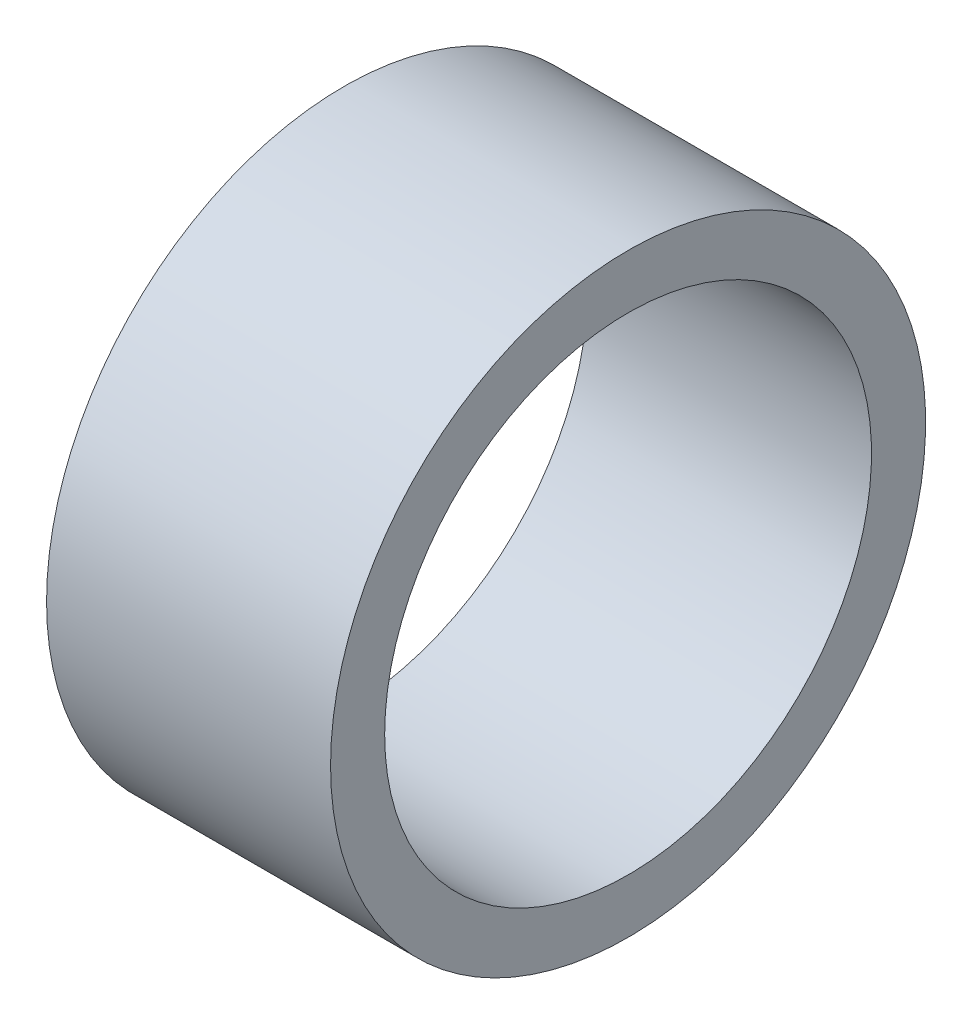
ISO-10303-21;
HEADER;
FILE_DESCRIPTION(('STEP AP214'),'2;1');
FILE_NAME('part.step','',(''),(''),'','','');
FILE_SCHEMA(('AUTOMOTIVE_DESIGN { 1 0 10303 214 1 1 1 1 }'));
ENDSEC;
DATA;
#1=APPLICATION_CONTEXT('core data for automotive mechanical design processes');
#2=APPLICATION_PROTOCOL_DEFINITION('international standard','automotive_design',2000,#1);
#3=PRODUCT_CONTEXT('',#1,'mechanical');
#4=PRODUCT('Part','Part','',(#3));
#5=PRODUCT_RELATED_PRODUCT_CATEGORY('part','',(#4));
#6=PRODUCT_DEFINITION_FORMATION('','',#4);
#7=PRODUCT_DEFINITION_CONTEXT('part definition',#1,'design');
#8=PRODUCT_DEFINITION('design','',#6,#7);
#9=PRODUCT_DEFINITION_SHAPE('','',#8);
#10=(LENGTH_UNIT() NAMED_UNIT(*) SI_UNIT(.MILLI.,.METRE.));
#11=(NAMED_UNIT(*) PLANE_ANGLE_UNIT() SI_UNIT($,.RADIAN.));
#12=(NAMED_UNIT(*) SI_UNIT($,.STERADIAN.) SOLID_ANGLE_UNIT());
#13=UNCERTAINTY_MEASURE_WITH_UNIT(LENGTH_MEASURE(1.E-05),#10,'distance_accuracy_value','');
#14=(GEOMETRIC_REPRESENTATION_CONTEXT(3) GLOBAL_UNCERTAINTY_ASSIGNED_CONTEXT((#13)) GLOBAL_UNIT_ASSIGNED_CONTEXT((#10,
#11,#12)) REPRESENTATION_CONTEXT('',''));
#15=CARTESIAN_POINT('',(0.,0.,0.));
#16=DIRECTION('',(0.,0.,1.));
#17=DIRECTION('',(1.,0.,0.));
#18=AXIS2_PLACEMENT_3D('',#15,#16,#17);
#19=CARTESIAN_POINT('',(21.,0.,0.));
#20=DIRECTION('',(-1.,0.,0.));
#21=DIRECTION('',(0.,0.,1.));
#22=AXIS2_PLACEMENT_3D('',#19,#20,#21);
#23=CYLINDRICAL_SURFACE('',#22,22.);
#24=CARTESIAN_POINT('',(21.,0.,0.));
#25=DIRECTION('',(-1.,0.,0.));
#26=DIRECTION('',(0.,0.,1.));
#27=AXIS2_PLACEMENT_3D('',#24,#25,#26);
#28=CIRCLE('',#27,22.);
#29=CARTESIAN_POINT('',(21.,0.,22.));
#30=VERTEX_POINT('',#29);
#31=EDGE_CURVE('E10',#30,#30,#28,.T.);
#32=ORIENTED_EDGE('',*,*,#31,.T.);
#33=EDGE_LOOP('',(#32));
#34=FACE_BOUND('',#33,.T.);
#35=CARTESIAN_POINT('',(0.,0.,0.));
#36=DIRECTION('',(-1.,0.,0.));
#37=DIRECTION('',(0.,0.,1.));
#38=AXIS2_PLACEMENT_3D('',#35,#36,#37);
#39=CIRCLE('',#38,22.);
#40=CARTESIAN_POINT('',(0.,0.,22.));
#41=VERTEX_POINT('',#40);
#42=EDGE_CURVE('E49',#41,#41,#39,.T.);
#43=ORIENTED_EDGE('',*,*,#42,.F.);
#44=EDGE_LOOP('',(#43));
#45=FACE_BOUND('',#44,.T.);
#46=ADVANCED_FACE('F35',(#34,#45),#23,.T.);
#47=CARTESIAN_POINT('',(21.,22.,0.));
#48=DIRECTION('',(1.,0.,0.));
#49=DIRECTION('',(0.,0.,-1.));
#50=AXIS2_PLACEMENT_3D('',#47,#48,#49);
#51=PLANE('',#50);
#52=CARTESIAN_POINT('',(21.,0.,0.));
#53=DIRECTION('',(-1.,0.,0.));
#54=DIRECTION('',(0.,0.,1.));
#55=AXIS2_PLACEMENT_3D('',#52,#53,#54);
#56=CIRCLE('',#55,18.);
#57=CARTESIAN_POINT('',(21.,0.,18.));
#58=VERTEX_POINT('',#57);
#59=EDGE_CURVE('E41',#58,#58,#56,.T.);
#60=ORIENTED_EDGE('',*,*,#59,.T.);
#61=EDGE_LOOP('',(#60));
#62=FACE_BOUND('',#61,.T.);
#63=ORIENTED_EDGE('',*,*,#31,.F.);
#64=EDGE_LOOP('',(#63));
#65=FACE_BOUND('',#64,.T.);
#66=ADVANCED_FACE('F59',(#62,#65),#51,.T.);
#67=CARTESIAN_POINT('',(21.,0.,0.));
#68=DIRECTION('',(-1.,0.,0.));
#69=DIRECTION('',(0.,0.,1.));
#70=AXIS2_PLACEMENT_3D('',#67,#68,#69);
#71=CYLINDRICAL_SURFACE('',#70,18.);
#72=CARTESIAN_POINT('',(0.,0.,0.));
#73=DIRECTION('',(-1.,0.,0.));
#74=DIRECTION('',(0.,0.,1.));
#75=AXIS2_PLACEMENT_3D('',#72,#73,#74);
#76=CIRCLE('',#75,18.);
#77=CARTESIAN_POINT('',(0.,0.,18.));
#78=VERTEX_POINT('',#77);
#79=EDGE_CURVE('E45',#78,#78,#76,.T.);
#80=ORIENTED_EDGE('',*,*,#79,.T.);
#81=EDGE_LOOP('',(#80));
#82=FACE_BOUND('',#81,.T.);
#83=ORIENTED_EDGE('',*,*,#59,.F.);
#84=EDGE_LOOP('',(#83));
#85=FACE_BOUND('',#84,.T.);
#86=ADVANCED_FACE('F63',(#82,#85),#71,.F.);
#87=CARTESIAN_POINT('',(0.,18.,0.));
#88=DIRECTION('',(-1.,0.,0.));
#89=DIRECTION('',(0.,0.,1.));
#90=AXIS2_PLACEMENT_3D('',#87,#88,#89);
#91=PLANE('',#90);
#92=ORIENTED_EDGE('',*,*,#42,.T.);
#93=EDGE_LOOP('',(#92));
#94=FACE_BOUND('',#93,.T.);
#95=ORIENTED_EDGE('',*,*,#79,.F.);
#96=EDGE_LOOP('',(#95));
#97=FACE_BOUND('',#96,.T.);
#98=ADVANCED_FACE('F55',(#94,#97),#91,.T.);
#99=CLOSED_SHELL('',(#46,#66,#86,#98));
#100=MANIFOLD_SOLID_BREP('B2',#99);
#101=ADVANCED_BREP_SHAPE_REPRESENTATION('',(#18,#100),#14);
#102=SHAPE_DEFINITION_REPRESENTATION(#9,#101);
ENDSEC;
END-ISO-10303-21;
